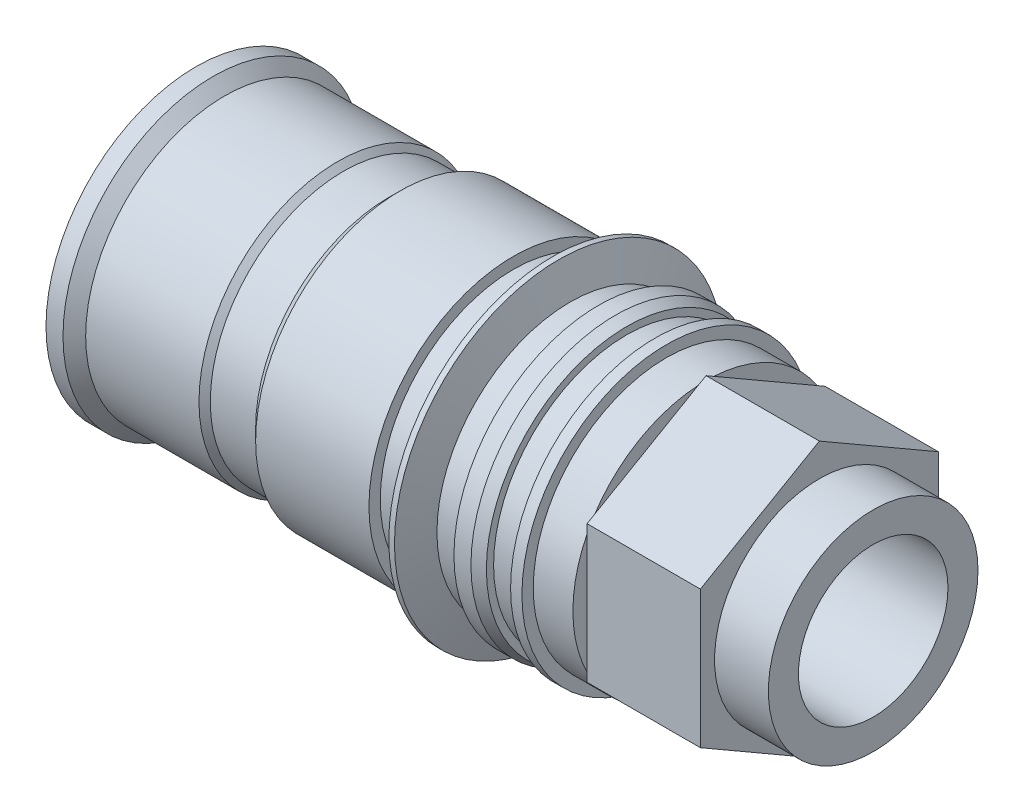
ISO-10303-21;
HEADER;
FILE_DESCRIPTION(('STEP AP214'),'2;1');
FILE_NAME('part.step','',(''),(''),'','','');
FILE_SCHEMA(('AUTOMOTIVE_DESIGN { 1 0 10303 214 1 1 1 1 }'));
ENDSEC;
DATA;
#1=APPLICATION_CONTEXT('core data for automotive mechanical design processes');
#2=APPLICATION_PROTOCOL_DEFINITION('international standard','automotive_design',2000,#1);
#3=PRODUCT_CONTEXT('',#1,'mechanical');
#4=PRODUCT('Part','Part','',(#3));
#5=PRODUCT_RELATED_PRODUCT_CATEGORY('part','',(#4));
#6=PRODUCT_DEFINITION_FORMATION('','',#4);
#7=PRODUCT_DEFINITION_CONTEXT('part definition',#1,'design');
#8=PRODUCT_DEFINITION('design','',#6,#7);
#9=PRODUCT_DEFINITION_SHAPE('','',#8);
#10=(LENGTH_UNIT() NAMED_UNIT(*) SI_UNIT(.MILLI.,.METRE.));
#11=(NAMED_UNIT(*) PLANE_ANGLE_UNIT() SI_UNIT($,.RADIAN.));
#12=(NAMED_UNIT(*) SI_UNIT($,.STERADIAN.) SOLID_ANGLE_UNIT());
#13=UNCERTAINTY_MEASURE_WITH_UNIT(LENGTH_MEASURE(1.E-05),#10,'distance_accuracy_value','');
#14=(GEOMETRIC_REPRESENTATION_CONTEXT(3) GLOBAL_UNCERTAINTY_ASSIGNED_CONTEXT((#13)) GLOBAL_UNIT_ASSIGNED_CONTEXT((#10,
#11,#12)) REPRESENTATION_CONTEXT('',''));
#15=CARTESIAN_POINT('',(0.,0.,0.));
#16=DIRECTION('',(0.,0.,1.));
#17=DIRECTION('',(1.,0.,0.));
#18=AXIS2_PLACEMENT_3D('',#15,#16,#17);
#19=CARTESIAN_POINT('',(90.,23.5,0.));
#20=DIRECTION('',(-1.,0.,0.));
#21=DIRECTION('',(0.,0.,1.));
#22=AXIS2_PLACEMENT_3D('',#19,#20,#21);
#23=PLANE('',#22);
#24=DIRECTION('',(0.,0.5,0.866025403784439));
#25=VECTOR('',#24,1.);
#26=CARTESIAN_POINT('',(90.,12.1243556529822,-21.));
#27=LINE('',#26,#25);
#28=CARTESIAN_POINT('',(90.,12.912777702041,-19.6344129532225));
#29=VERTEX_POINT('',#28);
#30=CARTESIAN_POINT('',(90.,23.4602892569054,-1.36558704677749));
#31=VERTEX_POINT('',#30);
#32=EDGE_CURVE('E42',#29,#31,#27,.T.);
#33=ORIENTED_EDGE('',*,*,#32,.F.);
#34=CARTESIAN_POINT('',(90.,0.,0.));
#35=DIRECTION('',(-1.,0.,0.));
#36=DIRECTION('',(0.,0.,1.));
#37=AXIS2_PLACEMENT_3D('',#34,#35,#36);
#38=CIRCLE('',#37,23.5);
#39=EDGE_CURVE('E297',#31,#29,#38,.T.);
#40=ORIENTED_EDGE('',*,*,#39,.F.);
#41=EDGE_LOOP('',(#33,#40));
#42=FACE_BOUND('',#41,.T.);
#43=ADVANCED_FACE('F33',(#42),#23,.F.);
#44=DIRECTION('',(0.,1.,0.));
#45=VECTOR('',#44,1.);
#46=CARTESIAN_POINT('',(90.,-12.1243556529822,-21.));
#47=LINE('',#46,#45);
#48=CARTESIAN_POINT('',(90.,-10.5475115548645,-21.));
#49=VERTEX_POINT('',#48);
#50=CARTESIAN_POINT('',(90.,10.5475115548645,-21.));
#51=VERTEX_POINT('',#50);
#52=EDGE_CURVE('E243',#49,#51,#47,.T.);
#53=ORIENTED_EDGE('',*,*,#52,.F.);
#54=EDGE_CURVE('E291',#51,#49,#38,.T.);
#55=ORIENTED_EDGE('',*,*,#54,.F.);
#56=EDGE_LOOP('',(#53,#55));
#57=FACE_BOUND('',#56,.T.);
#58=ADVANCED_FACE('F324',(#57),#23,.F.);
#59=DIRECTION('',(0.,0.5,-0.866025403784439));
#60=VECTOR('',#59,1.);
#61=CARTESIAN_POINT('',(90.,-24.2487113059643,0.));
#62=LINE('',#61,#60);
#63=CARTESIAN_POINT('',(90.,-23.4602892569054,-1.36558704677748));
#64=VERTEX_POINT('',#63);
#65=CARTESIAN_POINT('',(90.,-12.912777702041,-19.6344129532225));
#66=VERTEX_POINT('',#65);
#67=EDGE_CURVE('E245',#64,#66,#62,.T.);
#68=ORIENTED_EDGE('',*,*,#67,.F.);
#69=EDGE_CURVE('E285',#66,#64,#38,.T.);
#70=ORIENTED_EDGE('',*,*,#69,.F.);
#71=EDGE_LOOP('',(#68,#70));
#72=FACE_BOUND('',#71,.T.);
#73=ADVANCED_FACE('F331',(#72),#23,.F.);
#74=DIRECTION('',(0.,-0.5,-0.866025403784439));
#75=VECTOR('',#74,1.);
#76=CARTESIAN_POINT('',(90.,-12.1243556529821,21.));
#77=LINE('',#76,#75);
#78=CARTESIAN_POINT('',(90.,-12.912777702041,19.6344129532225));
#79=VERTEX_POINT('',#78);
#80=CARTESIAN_POINT('',(90.,-23.4602892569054,1.36558704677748));
#81=VERTEX_POINT('',#80);
#82=EDGE_CURVE('E56',#79,#81,#77,.T.);
#83=ORIENTED_EDGE('',*,*,#82,.F.);
#84=EDGE_CURVE('E282',#81,#79,#38,.T.);
#85=ORIENTED_EDGE('',*,*,#84,.F.);
#86=EDGE_LOOP('',(#83,#85));
#87=FACE_BOUND('',#86,.T.);
#88=ADVANCED_FACE('F343',(#87),#23,.F.);
#89=DIRECTION('',(0.,-1.,0.));
#90=VECTOR('',#89,1.);
#91=CARTESIAN_POINT('',(90.,12.1243556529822,21.));
#92=LINE('',#91,#90);
#93=CARTESIAN_POINT('',(90.,10.5475115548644,21.));
#94=VERTEX_POINT('',#93);
#95=CARTESIAN_POINT('',(90.,-10.5475115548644,21.));
#96=VERTEX_POINT('',#95);
#97=EDGE_CURVE('E229',#94,#96,#92,.T.);
#98=ORIENTED_EDGE('',*,*,#97,.F.);
#99=EDGE_CURVE('E49',#96,#94,#38,.T.);
#100=ORIENTED_EDGE('',*,*,#99,.F.);
#101=EDGE_LOOP('',(#98,#100));
#102=FACE_BOUND('',#101,.T.);
#103=ADVANCED_FACE('F336',(#102),#23,.F.);
#104=DIRECTION('',(0.,-0.5,0.866025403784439));
#105=VECTOR('',#104,1.);
#106=CARTESIAN_POINT('',(90.,24.2487113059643,0.));
#107=LINE('',#106,#105);
#108=CARTESIAN_POINT('',(90.,23.4602892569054,1.36558704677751));
#109=VERTEX_POINT('',#108);
#110=CARTESIAN_POINT('',(90.,12.912777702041,19.6344129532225));
#111=VERTEX_POINT('',#110);
#112=EDGE_CURVE('E225',#109,#111,#107,.T.);
#113=ORIENTED_EDGE('',*,*,#112,.F.);
#114=EDGE_CURVE('E161',#111,#109,#38,.T.);
#115=ORIENTED_EDGE('',*,*,#114,.F.);
#116=EDGE_LOOP('',(#113,#115));
#117=FACE_BOUND('',#116,.T.);
#118=ADVANCED_FACE('F327',(#117),#23,.F.);
#119=CARTESIAN_POINT('',(0.,0.,0.));
#120=DIRECTION('',(1.,0.,0.));
#121=DIRECTION('',(0.,0.,-1.));
#122=AXIS2_PLACEMENT_3D('',#119,#120,#121);
#123=PLANE('',#122);
#124=CARTESIAN_POINT('',(0.,0.,0.));
#125=DIRECTION('',(1.,0.,0.));
#126=DIRECTION('',(0.,0.,-1.));
#127=AXIS2_PLACEMENT_3D('',#124,#125,#126);
#128=CIRCLE('',#127,13.2);
#129=CARTESIAN_POINT('',(0.,0.,-13.2));
#130=VERTEX_POINT('',#129);
#131=EDGE_CURVE('E398',#130,#130,#128,.T.);
#132=ORIENTED_EDGE('',*,*,#131,.T.);
#133=EDGE_LOOP('',(#132));
#134=FACE_BOUND('',#133,.T.);
#135=CARTESIAN_POINT('',(0.,0.,0.));
#136=DIRECTION('',(-1.,0.,0.));
#137=DIRECTION('',(0.,0.,1.));
#138=AXIS2_PLACEMENT_3D('',#135,#136,#137);
#139=CIRCLE('',#138,26.5);
#140=CARTESIAN_POINT('',(0.,0.,26.5));
#141=VERTEX_POINT('',#140);
#142=EDGE_CURVE('E37',#141,#141,#139,.T.);
#143=ORIENTED_EDGE('',*,*,#142,.T.);
#144=EDGE_LOOP('',(#143));
#145=FACE_BOUND('',#144,.T.);
#146=ADVANCED_FACE('F35',(#134,#145),#123,.F.);
#147=CARTESIAN_POINT('',(0.,0.,0.));
#148=DIRECTION('',(-1.,0.,0.));
#149=DIRECTION('',(0.,0.,1.));
#150=AXIS2_PLACEMENT_3D('',#147,#148,#149);
#151=CYLINDRICAL_SURFACE('',#150,26.5);
#152=ORIENTED_EDGE('',*,*,#142,.F.);
#153=EDGE_LOOP('',(#152));
#154=FACE_BOUND('',#153,.T.);
#155=CARTESIAN_POINT('',(3.,0.,0.));
#156=DIRECTION('',(-1.,0.,0.));
#157=DIRECTION('',(0.,0.,1.));
#158=AXIS2_PLACEMENT_3D('',#155,#156,#157);
#159=CIRCLE('',#158,26.5);
#160=CARTESIAN_POINT('',(3.,0.,26.5));
#161=VERTEX_POINT('',#160);
#162=EDGE_CURVE('E220',#161,#161,#159,.T.);
#163=ORIENTED_EDGE('',*,*,#162,.T.);
#164=EDGE_LOOP('',(#163));
#165=FACE_BOUND('',#164,.T.);
#166=ADVANCED_FACE('F341',(#154,#165),#151,.T.);
#167=CARTESIAN_POINT('',(5.,0.,0.));
#168=DIRECTION('',(-1.,0.,0.));
#169=DIRECTION('',(0.,0.,1.));
#170=AXIS2_PLACEMENT_3D('',#167,#168,#169);
#171=CONICAL_SURFACE('',#170,24.5,0.78539816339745);
#172=ORIENTED_EDGE('',*,*,#162,.F.);
#173=EDGE_LOOP('',(#172));
#174=FACE_BOUND('',#173,.T.);
#175=CARTESIAN_POINT('',(5.,0.,0.));
#176=DIRECTION('',(-1.,0.,0.));
#177=DIRECTION('',(0.,0.,1.));
#178=AXIS2_PLACEMENT_3D('',#175,#176,#177);
#179=CIRCLE('',#178,24.5);
#180=CARTESIAN_POINT('',(5.,0.,24.5));
#181=VERTEX_POINT('',#180);
#182=EDGE_CURVE('E218',#181,#181,#179,.T.);
#183=ORIENTED_EDGE('',*,*,#182,.T.);
#184=EDGE_LOOP('',(#183));
#185=FACE_BOUND('',#184,.T.);
#186=ADVANCED_FACE('F440',(#174,#185),#171,.T.);
#187=CARTESIAN_POINT('',(0.,0.,0.));
#188=DIRECTION('',(-1.,0.,0.));
#189=DIRECTION('',(0.,0.,1.));
#190=AXIS2_PLACEMENT_3D('',#187,#188,#189);
#191=CYLINDRICAL_SURFACE('',#190,24.5);
#192=ORIENTED_EDGE('',*,*,#182,.F.);
#193=EDGE_LOOP('',(#192));
#194=FACE_BOUND('',#193,.T.);
#195=CARTESIAN_POINT('',(25.,0.,0.));
#196=DIRECTION('',(-1.,0.,0.));
#197=DIRECTION('',(0.,0.,1.));
#198=AXIS2_PLACEMENT_3D('',#195,#196,#197);
#199=CIRCLE('',#198,24.5);
#200=CARTESIAN_POINT('',(25.,0.,24.5));
#201=VERTEX_POINT('',#200);
#202=EDGE_CURVE('E215',#201,#201,#199,.T.);
#203=ORIENTED_EDGE('',*,*,#202,.T.);
#204=EDGE_LOOP('',(#203));
#205=FACE_BOUND('',#204,.T.);
#206=ADVANCED_FACE('F446',(#194,#205),#191,.T.);
#207=CARTESIAN_POINT('',(26.,0.,0.));
#208=DIRECTION('',(-1.,0.,0.));
#209=DIRECTION('',(0.,0.,1.));
#210=AXIS2_PLACEMENT_3D('',#207,#208,#209);
#211=CONICAL_SURFACE('',#210,23.5,0.785398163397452);
#212=ORIENTED_EDGE('',*,*,#202,.F.);
#213=EDGE_LOOP('',(#212));
#214=FACE_BOUND('',#213,.T.);
#215=CARTESIAN_POINT('',(26.,0.,0.));
#216=DIRECTION('',(-1.,0.,0.));
#217=DIRECTION('',(0.,0.,1.));
#218=AXIS2_PLACEMENT_3D('',#215,#216,#217);
#219=CIRCLE('',#218,23.5);
#220=CARTESIAN_POINT('',(26.,0.,23.5));
#221=VERTEX_POINT('',#220);
#222=EDGE_CURVE('E212',#221,#221,#219,.T.);
#223=ORIENTED_EDGE('',*,*,#222,.T.);
#224=EDGE_LOOP('',(#223));
#225=FACE_BOUND('',#224,.T.);
#226=ADVANCED_FACE('F454',(#214,#225),#211,.T.);
#227=CARTESIAN_POINT('',(0.,0.,0.));
#228=DIRECTION('',(-1.,0.,0.));
#229=DIRECTION('',(0.,0.,1.));
#230=AXIS2_PLACEMENT_3D('',#227,#228,#229);
#231=CYLINDRICAL_SURFACE('',#230,23.5);
#232=ORIENTED_EDGE('',*,*,#222,.F.);
#233=EDGE_LOOP('',(#232));
#234=FACE_BOUND('',#233,.T.);
#235=CARTESIAN_POINT('',(34.,0.,0.));
#236=DIRECTION('',(-1.,0.,0.));
#237=DIRECTION('',(0.,0.,1.));
#238=AXIS2_PLACEMENT_3D('',#235,#236,#237);
#239=CIRCLE('',#238,23.5);
#240=CARTESIAN_POINT('',(34.,0.,23.5));
#241=VERTEX_POINT('',#240);
#242=EDGE_CURVE('E209',#241,#241,#239,.T.);
#243=ORIENTED_EDGE('',*,*,#242,.T.);
#244=EDGE_LOOP('',(#243));
#245=FACE_BOUND('',#244,.T.);
#246=ADVANCED_FACE('F462',(#234,#245),#231,.T.);
#247=CARTESIAN_POINT('',(36.,0.,0.));
#248=DIRECTION('',(1.,0.,0.));
#249=DIRECTION('',(0.,0.,-1.));
#250=AXIS2_PLACEMENT_3D('',#247,#248,#249);
#251=CONICAL_SURFACE('',#250,25.5,0.785398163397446);
#252=ORIENTED_EDGE('',*,*,#242,.F.);
#253=EDGE_LOOP('',(#252));
#254=FACE_BOUND('',#253,.T.);
#255=CARTESIAN_POINT('',(36.,0.,0.));
#256=DIRECTION('',(-1.,0.,0.));
#257=DIRECTION('',(0.,0.,1.));
#258=AXIS2_PLACEMENT_3D('',#255,#256,#257);
#259=CIRCLE('',#258,25.5);
#260=CARTESIAN_POINT('',(36.,0.,25.5));
#261=VERTEX_POINT('',#260);
#262=EDGE_CURVE('E206',#261,#261,#259,.T.);
#263=ORIENTED_EDGE('',*,*,#262,.T.);
#264=EDGE_LOOP('',(#263));
#265=FACE_BOUND('',#264,.T.);
#266=ADVANCED_FACE('F470',(#254,#265),#251,.T.);
#267=CARTESIAN_POINT('',(0.,0.,0.));
#268=DIRECTION('',(-1.,0.,0.));
#269=DIRECTION('',(0.,0.,1.));
#270=AXIS2_PLACEMENT_3D('',#267,#268,#269);
#271=CYLINDRICAL_SURFACE('',#270,25.5);
#272=ORIENTED_EDGE('',*,*,#262,.F.);
#273=EDGE_LOOP('',(#272));
#274=FACE_BOUND('',#273,.T.);
#275=CARTESIAN_POINT('',(56.,0.,0.));
#276=DIRECTION('',(-1.,0.,0.));
#277=DIRECTION('',(0.,0.,1.));
#278=AXIS2_PLACEMENT_3D('',#275,#276,#277);
#279=CIRCLE('',#278,25.5);
#280=CARTESIAN_POINT('',(56.,0.,25.5));
#281=VERTEX_POINT('',#280);
#282=EDGE_CURVE('E203',#281,#281,#279,.T.);
#283=ORIENTED_EDGE('',*,*,#282,.T.);
#284=EDGE_LOOP('',(#283));
#285=FACE_BOUND('',#284,.T.);
#286=ADVANCED_FACE('F478',(#274,#285),#271,.T.);
#287=CARTESIAN_POINT('',(56.,25.5,0.));
#288=DIRECTION('',(-1.,0.,0.));
#289=DIRECTION('',(0.,0.,1.));
#290=AXIS2_PLACEMENT_3D('',#287,#288,#289);
#291=PLANE('',#290);
#292=ORIENTED_EDGE('',*,*,#282,.F.);
#293=EDGE_LOOP('',(#292));
#294=FACE_BOUND('',#293,.T.);
#295=CARTESIAN_POINT('',(56.,0.,0.));
#296=DIRECTION('',(-1.,0.,0.));
#297=DIRECTION('',(0.,0.,1.));
#298=AXIS2_PLACEMENT_3D('',#295,#296,#297);
#299=CIRCLE('',#298,23.5);
#300=CARTESIAN_POINT('',(56.,0.,23.5));
#301=VERTEX_POINT('',#300);
#302=EDGE_CURVE('E200',#301,#301,#299,.T.);
#303=ORIENTED_EDGE('',*,*,#302,.T.);
#304=EDGE_LOOP('',(#303));
#305=FACE_BOUND('',#304,.T.);
#306=ADVANCED_FACE('F486',(#294,#305),#291,.F.);
#307=CARTESIAN_POINT('',(0.,0.,0.));
#308=DIRECTION('',(-1.,0.,0.));
#309=DIRECTION('',(0.,0.,1.));
#310=AXIS2_PLACEMENT_3D('',#307,#308,#309);
#311=CYLINDRICAL_SURFACE('',#310,23.5);
#312=ORIENTED_EDGE('',*,*,#302,.F.);
#313=EDGE_LOOP('',(#312));
#314=FACE_BOUND('',#313,.T.);
#315=CARTESIAN_POINT('',(61.,0.,0.));
#316=DIRECTION('',(-1.,0.,0.));
#317=DIRECTION('',(0.,0.,1.));
#318=AXIS2_PLACEMENT_3D('',#315,#316,#317);
#319=CIRCLE('',#318,23.5);
#320=CARTESIAN_POINT('',(61.,0.,23.5));
#321=VERTEX_POINT('',#320);
#322=EDGE_CURVE('E197',#321,#321,#319,.T.);
#323=ORIENTED_EDGE('',*,*,#322,.T.);
#324=EDGE_LOOP('',(#323));
#325=FACE_BOUND('',#324,.T.);
#326=ADVANCED_FACE('F494',(#314,#325),#311,.T.);
#327=CARTESIAN_POINT('',(63.,0.,0.));
#328=DIRECTION('',(1.,0.,0.));
#329=DIRECTION('',(0.,0.,-1.));
#330=AXIS2_PLACEMENT_3D('',#327,#328,#329);
#331=CONICAL_SURFACE('',#330,28.9949548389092,1.22173047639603);
#332=ORIENTED_EDGE('',*,*,#322,.F.);
#333=EDGE_LOOP('',(#332));
#334=FACE_BOUND('',#333,.T.);
#335=CARTESIAN_POINT('',(63.,0.,0.));
#336=DIRECTION('',(-1.,0.,0.));
#337=DIRECTION('',(0.,0.,1.));
#338=AXIS2_PLACEMENT_3D('',#335,#336,#337);
#339=CIRCLE('',#338,28.9949548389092);
#340=CARTESIAN_POINT('',(63.,0.,28.9949548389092));
#341=VERTEX_POINT('',#340);
#342=EDGE_CURVE('E194',#341,#341,#339,.T.);
#343=ORIENTED_EDGE('',*,*,#342,.T.);
#344=EDGE_LOOP('',(#343));
#345=FACE_BOUND('',#344,.T.);
#346=ADVANCED_FACE('F502',(#334,#345),#331,.T.);
#347=CARTESIAN_POINT('',(0.,0.,0.));
#348=DIRECTION('',(-1.,0.,0.));
#349=DIRECTION('',(0.,0.,1.));
#350=AXIS2_PLACEMENT_3D('',#347,#348,#349);
#351=CYLINDRICAL_SURFACE('',#350,28.9949548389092);
#352=ORIENTED_EDGE('',*,*,#342,.F.);
#353=EDGE_LOOP('',(#352));
#354=FACE_BOUND('',#353,.T.);
#355=CARTESIAN_POINT('',(64.,0.,0.));
#356=DIRECTION('',(-1.,0.,0.));
#357=DIRECTION('',(0.,0.,1.));
#358=AXIS2_PLACEMENT_3D('',#355,#356,#357);
#359=CIRCLE('',#358,28.9949548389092);
#360=CARTESIAN_POINT('',(64.,0.,28.9949548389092));
#361=VERTEX_POINT('',#360);
#362=EDGE_CURVE('E191',#361,#361,#359,.T.);
#363=ORIENTED_EDGE('',*,*,#362,.T.);
#364=EDGE_LOOP('',(#363));
#365=FACE_BOUND('',#364,.T.);
#366=ADVANCED_FACE('F510',(#354,#365),#351,.T.);
#367=CARTESIAN_POINT('',(66.,0.,0.));
#368=DIRECTION('',(-1.,0.,0.));
#369=DIRECTION('',(0.,0.,1.));
#370=AXIS2_PLACEMENT_3D('',#367,#368,#369);
#371=CONICAL_SURFACE('',#370,23.5,1.22173047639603);
#372=ORIENTED_EDGE('',*,*,#362,.F.);
#373=EDGE_LOOP('',(#372));
#374=FACE_BOUND('',#373,.T.);
#375=CARTESIAN_POINT('',(66.,0.,0.));
#376=DIRECTION('',(-1.,0.,0.));
#377=DIRECTION('',(0.,0.,1.));
#378=AXIS2_PLACEMENT_3D('',#375,#376,#377);
#379=CIRCLE('',#378,23.5);
#380=CARTESIAN_POINT('',(66.,0.,23.5));
#381=VERTEX_POINT('',#380);
#382=EDGE_CURVE('E188',#381,#381,#379,.T.);
#383=ORIENTED_EDGE('',*,*,#382,.T.);
#384=EDGE_LOOP('',(#383));
#385=FACE_BOUND('',#384,.T.);
#386=ADVANCED_FACE('F518',(#374,#385),#371,.T.);
#387=CARTESIAN_POINT('',(0.,0.,0.));
#388=DIRECTION('',(-1.,0.,0.));
#389=DIRECTION('',(0.,0.,1.));
#390=AXIS2_PLACEMENT_3D('',#387,#388,#389);
#391=CYLINDRICAL_SURFACE('',#390,23.5);
#392=ORIENTED_EDGE('',*,*,#382,.F.);
#393=EDGE_LOOP('',(#392));
#394=FACE_BOUND('',#393,.T.);
#395=CARTESIAN_POINT('',(71.,0.,0.));
#396=DIRECTION('',(-1.,0.,0.));
#397=DIRECTION('',(0.,0.,1.));
#398=AXIS2_PLACEMENT_3D('',#395,#396,#397);
#399=CIRCLE('',#398,23.5);
#400=CARTESIAN_POINT('',(71.,0.,23.5));
#401=VERTEX_POINT('',#400);
#402=EDGE_CURVE('E185',#401,#401,#399,.T.);
#403=ORIENTED_EDGE('',*,*,#402,.T.);
#404=EDGE_LOOP('',(#403));
#405=FACE_BOUND('',#404,.T.);
#406=ADVANCED_FACE('F526',(#394,#405),#391,.T.);
#407=CARTESIAN_POINT('',(71.,23.5,0.));
#408=DIRECTION('',(1.,0.,0.));
#409=DIRECTION('',(0.,0.,-1.));
#410=AXIS2_PLACEMENT_3D('',#407,#408,#409);
#411=PLANE('',#410);
#412=ORIENTED_EDGE('',*,*,#402,.F.);
#413=EDGE_LOOP('',(#412));
#414=FACE_BOUND('',#413,.T.);
#415=CARTESIAN_POINT('',(71.,0.,0.));
#416=DIRECTION('',(-1.,0.,0.));
#417=DIRECTION('',(0.,0.,1.));
#418=AXIS2_PLACEMENT_3D('',#415,#416,#417);
#419=CIRCLE('',#418,25.5);
#420=CARTESIAN_POINT('',(71.,0.,25.5));
#421=VERTEX_POINT('',#420);
#422=EDGE_CURVE('E182',#421,#421,#419,.T.);
#423=ORIENTED_EDGE('',*,*,#422,.T.);
#424=EDGE_LOOP('',(#423));
#425=FACE_BOUND('',#424,.T.);
#426=ADVANCED_FACE('F534',(#414,#425),#411,.F.);
#427=CARTESIAN_POINT('',(0.,0.,0.));
#428=DIRECTION('',(-1.,0.,0.));
#429=DIRECTION('',(0.,0.,1.));
#430=AXIS2_PLACEMENT_3D('',#427,#428,#429);
#431=CYLINDRICAL_SURFACE('',#430,25.5);
#432=ORIENTED_EDGE('',*,*,#422,.F.);
#433=EDGE_LOOP('',(#432));
#434=FACE_BOUND('',#433,.T.);
#435=CARTESIAN_POINT('',(74.,0.,0.));
#436=DIRECTION('',(-1.,0.,0.));
#437=DIRECTION('',(0.,0.,1.));
#438=AXIS2_PLACEMENT_3D('',#435,#436,#437);
#439=CIRCLE('',#438,25.5);
#440=CARTESIAN_POINT('',(74.,0.,25.5));
#441=VERTEX_POINT('',#440);
#442=EDGE_CURVE('E179',#441,#441,#439,.T.);
#443=ORIENTED_EDGE('',*,*,#442,.T.);
#444=EDGE_LOOP('',(#443));
#445=FACE_BOUND('',#444,.T.);
#446=ADVANCED_FACE('F542',(#434,#445),#431,.T.);
#447=CARTESIAN_POINT('',(76.,0.,0.));
#448=DIRECTION('',(-1.,0.,0.));
#449=DIRECTION('',(0.,0.,1.));
#450=AXIS2_PLACEMENT_3D('',#447,#448,#449);
#451=CONICAL_SURFACE('',#450,24.7720595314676,0.349065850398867);
#452=ORIENTED_EDGE('',*,*,#442,.F.);
#453=EDGE_LOOP('',(#452));
#454=FACE_BOUND('',#453,.T.);
#455=CARTESIAN_POINT('',(76.,0.,0.));
#456=DIRECTION('',(-1.,0.,0.));
#457=DIRECTION('',(0.,0.,1.));
#458=AXIS2_PLACEMENT_3D('',#455,#456,#457);
#459=CIRCLE('',#458,24.7720595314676);
#460=CARTESIAN_POINT('',(76.,0.,24.7720595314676));
#461=VERTEX_POINT('',#460);
#462=EDGE_CURVE('E176',#461,#461,#459,.T.);
#463=ORIENTED_EDGE('',*,*,#462,.T.);
#464=EDGE_LOOP('',(#463));
#465=FACE_BOUND('',#464,.T.);
#466=ADVANCED_FACE('F550',(#454,#465),#451,.T.);
#467=CARTESIAN_POINT('',(76.,24.7720595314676,0.));
#468=DIRECTION('',(-1.,0.,0.));
#469=DIRECTION('',(0.,0.,1.));
#470=AXIS2_PLACEMENT_3D('',#467,#468,#469);
#471=PLANE('',#470);
#472=ORIENTED_EDGE('',*,*,#462,.F.);
#473=EDGE_LOOP('',(#472));
#474=FACE_BOUND('',#473,.T.);
#475=CARTESIAN_POINT('',(76.,0.,0.));
#476=DIRECTION('',(-1.,0.,0.));
#477=DIRECTION('',(0.,0.,1.));
#478=AXIS2_PLACEMENT_3D('',#475,#476,#477);
#479=CIRCLE('',#478,23.5);
#480=CARTESIAN_POINT('',(76.,0.,23.5));
#481=VERTEX_POINT('',#480);
#482=EDGE_CURVE('E173',#481,#481,#479,.T.);
#483=ORIENTED_EDGE('',*,*,#482,.T.);
#484=EDGE_LOOP('',(#483));
#485=FACE_BOUND('',#484,.T.);
#486=ADVANCED_FACE('F558',(#474,#485),#471,.F.);
#487=CARTESIAN_POINT('',(0.,0.,0.));
#488=DIRECTION('',(-1.,0.,0.));
#489=DIRECTION('',(0.,0.,1.));
#490=AXIS2_PLACEMENT_3D('',#487,#488,#489);
#491=CYLINDRICAL_SURFACE('',#490,23.5);
#492=ORIENTED_EDGE('',*,*,#482,.F.);
#493=EDGE_LOOP('',(#492));
#494=FACE_BOUND('',#493,.T.);
#495=CARTESIAN_POINT('',(81.,0.,0.));
#496=DIRECTION('',(-1.,0.,0.));
#497=DIRECTION('',(0.,0.,1.));
#498=AXIS2_PLACEMENT_3D('',#495,#496,#497);
#499=CIRCLE('',#498,23.5);
#500=CARTESIAN_POINT('',(81.,0.,23.5));
#501=VERTEX_POINT('',#500);
#502=EDGE_CURVE('E170',#501,#501,#499,.T.);
#503=ORIENTED_EDGE('',*,*,#502,.T.);
#504=EDGE_LOOP('',(#503));
#505=FACE_BOUND('',#504,.T.);
#506=ADVANCED_FACE('F566',(#494,#505),#491,.T.);
#507=CARTESIAN_POINT('',(81.,23.5,0.));
#508=DIRECTION('',(1.,0.,0.));
#509=DIRECTION('',(0.,0.,-1.));
#510=AXIS2_PLACEMENT_3D('',#507,#508,#509);
#511=PLANE('',#510);
#512=ORIENTED_EDGE('',*,*,#502,.F.);
#513=EDGE_LOOP('',(#512));
#514=FACE_BOUND('',#513,.T.);
#515=CARTESIAN_POINT('',(81.,0.,0.));
#516=DIRECTION('',(-1.,0.,0.));
#517=DIRECTION('',(0.,0.,1.));
#518=AXIS2_PLACEMENT_3D('',#515,#516,#517);
#519=CIRCLE('',#518,25.5);
#520=CARTESIAN_POINT('',(81.,0.,25.5));
#521=VERTEX_POINT('',#520);
#522=EDGE_CURVE('E167',#521,#521,#519,.T.);
#523=ORIENTED_EDGE('',*,*,#522,.T.);
#524=EDGE_LOOP('',(#523));
#525=FACE_BOUND('',#524,.T.);
#526=ADVANCED_FACE('F574',(#514,#525),#511,.F.);
#527=CARTESIAN_POINT('',(0.,0.,0.));
#528=DIRECTION('',(-1.,0.,0.));
#529=DIRECTION('',(0.,0.,1.));
#530=AXIS2_PLACEMENT_3D('',#527,#528,#529);
#531=CYLINDRICAL_SURFACE('',#530,25.5);
#532=ORIENTED_EDGE('',*,*,#522,.F.);
#533=EDGE_LOOP('',(#532));
#534=FACE_BOUND('',#533,.T.);
#535=CARTESIAN_POINT('',(83.,0.,0.));
#536=DIRECTION('',(-1.,0.,0.));
#537=DIRECTION('',(0.,0.,1.));
#538=AXIS2_PLACEMENT_3D('',#535,#536,#537);
#539=CIRCLE('',#538,25.5);
#540=CARTESIAN_POINT('',(83.,0.,25.5));
#541=VERTEX_POINT('',#540);
#542=EDGE_CURVE('E164',#541,#541,#539,.T.);
#543=ORIENTED_EDGE('',*,*,#542,.T.);
#544=EDGE_LOOP('',(#543));
#545=FACE_BOUND('',#544,.T.);
#546=ADVANCED_FACE('F582',(#534,#545),#531,.T.);
#547=CARTESIAN_POINT('',(83.,25.5,0.));
#548=DIRECTION('',(-1.,0.,0.));
#549=DIRECTION('',(0.,0.,1.));
#550=AXIS2_PLACEMENT_3D('',#547,#548,#549);
#551=PLANE('',#550);
#552=ORIENTED_EDGE('',*,*,#542,.F.);
#553=EDGE_LOOP('',(#552));
#554=FACE_BOUND('',#553,.T.);
#555=CARTESIAN_POINT('',(83.,0.,0.));
#556=DIRECTION('',(-1.,0.,0.));
#557=DIRECTION('',(0.,0.,1.));
#558=AXIS2_PLACEMENT_3D('',#555,#556,#557);
#559=CIRCLE('',#558,23.5);
#560=CARTESIAN_POINT('',(83.,0.,23.5));
#561=VERTEX_POINT('',#560);
#562=EDGE_CURVE('E160',#561,#561,#559,.T.);
#563=ORIENTED_EDGE('',*,*,#562,.T.);
#564=EDGE_LOOP('',(#563));
#565=FACE_BOUND('',#564,.T.);
#566=ADVANCED_FACE('F590',(#554,#565),#551,.F.);
#567=CARTESIAN_POINT('',(0.,0.,0.));
#568=DIRECTION('',(-1.,0.,0.));
#569=DIRECTION('',(0.,0.,1.));
#570=AXIS2_PLACEMENT_3D('',#567,#568,#569);
#571=CYLINDRICAL_SURFACE('',#570,23.5);
#572=ORIENTED_EDGE('',*,*,#562,.F.);
#573=EDGE_LOOP('',(#572));
#574=FACE_BOUND('',#573,.T.);
#575=EDGE_CURVE('E155',#94,#111,#38,.T.);
#576=ORIENTED_EDGE('',*,*,#575,.T.);
#577=ORIENTED_EDGE('',*,*,#114,.T.);
#578=EDGE_CURVE('E300',#109,#31,#38,.T.);
#579=ORIENTED_EDGE('',*,*,#578,.T.);
#580=ORIENTED_EDGE('',*,*,#39,.T.);
#581=EDGE_CURVE('E295',#29,#51,#38,.T.);
#582=ORIENTED_EDGE('',*,*,#581,.T.);
#583=ORIENTED_EDGE('',*,*,#54,.T.);
#584=EDGE_CURVE('E289',#49,#66,#38,.T.);
#585=ORIENTED_EDGE('',*,*,#584,.T.);
#586=ORIENTED_EDGE('',*,*,#69,.T.);
#587=EDGE_CURVE('E283',#64,#81,#38,.T.);
#588=ORIENTED_EDGE('',*,*,#587,.T.);
#589=ORIENTED_EDGE('',*,*,#84,.T.);
#590=EDGE_CURVE('E153',#79,#96,#38,.T.);
#591=ORIENTED_EDGE('',*,*,#590,.T.);
#592=ORIENTED_EDGE('',*,*,#99,.T.);
#593=EDGE_LOOP('',(#576,#577,#579,#580,#582,#583,#585,#586,#588,#589,#591,#592));
#594=FACE_BOUND('',#593,.T.);
#595=ADVANCED_FACE('F305',(#574,#594),#571,.T.);
#596=CARTESIAN_POINT('',(90.,0.,0.));
#597=DIRECTION('',(1.,0.,0.));
#598=DIRECTION('',(0.,0.,-1.));
#599=AXIS2_PLACEMENT_3D('',#596,#597,#598);
#600=PLANE('',#599);
#601=ORIENTED_EDGE('',*,*,#575,.F.);
#602=CARTESIAN_POINT('',(90.,12.1243556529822,21.));
#603=VERTEX_POINT('',#602);
#604=EDGE_CURVE('E235',#603,#94,#92,.T.);
#605=ORIENTED_EDGE('',*,*,#604,.F.);
#606=EDGE_CURVE('E232',#111,#603,#107,.T.);
#607=ORIENTED_EDGE('',*,*,#606,.F.);
#608=EDGE_LOOP('',(#601,#605,#607));
#609=FACE_BOUND('',#608,.T.);
#610=ADVANCED_FACE('F312',(#609),#600,.F.);
#611=ORIENTED_EDGE('',*,*,#578,.F.);
#612=CARTESIAN_POINT('',(90.,24.2487113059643,0.));
#613=VERTEX_POINT('',#612);
#614=EDGE_CURVE('E231',#613,#109,#107,.T.);
#615=ORIENTED_EDGE('',*,*,#614,.F.);
#616=EDGE_CURVE('E150',#31,#613,#27,.T.);
#617=ORIENTED_EDGE('',*,*,#616,.F.);
#618=EDGE_LOOP('',(#611,#615,#617));
#619=FACE_BOUND('',#618,.T.);
#620=ADVANCED_FACE('F309',(#619),#600,.F.);
#621=ORIENTED_EDGE('',*,*,#581,.F.);
#622=CARTESIAN_POINT('',(90.,12.1243556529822,-21.));
#623=VERTEX_POINT('',#622);
#624=EDGE_CURVE('E238',#623,#29,#27,.T.);
#625=ORIENTED_EDGE('',*,*,#624,.F.);
#626=EDGE_CURVE('E247',#51,#623,#47,.T.);
#627=ORIENTED_EDGE('',*,*,#626,.F.);
#628=EDGE_LOOP('',(#621,#625,#627));
#629=FACE_BOUND('',#628,.T.);
#630=ADVANCED_FACE('F311',(#629),#600,.F.);
#631=ORIENTED_EDGE('',*,*,#584,.F.);
#632=CARTESIAN_POINT('',(90.,-12.1243556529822,-21.));
#633=VERTEX_POINT('',#632);
#634=EDGE_CURVE('E144',#633,#49,#47,.T.);
#635=ORIENTED_EDGE('',*,*,#634,.F.);
#636=EDGE_CURVE('E253',#66,#633,#62,.T.);
#637=ORIENTED_EDGE('',*,*,#636,.F.);
#638=EDGE_LOOP('',(#631,#635,#637));
#639=FACE_BOUND('',#638,.T.);
#640=ADVANCED_FACE('F318',(#639),#600,.F.);
#641=ORIENTED_EDGE('',*,*,#587,.F.);
#642=CARTESIAN_POINT('',(90.,-24.2487113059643,0.));
#643=VERTEX_POINT('',#642);
#644=EDGE_CURVE('E252',#643,#64,#62,.T.);
#645=ORIENTED_EDGE('',*,*,#644,.F.);
#646=EDGE_CURVE('E263',#81,#643,#77,.T.);
#647=ORIENTED_EDGE('',*,*,#646,.F.);
#648=EDGE_LOOP('',(#641,#645,#647));
#649=FACE_BOUND('',#648,.T.);
#650=ADVANCED_FACE('F364',(#649),#600,.F.);
#651=CARTESIAN_POINT('',(110.,12.1243556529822,-21.));
#652=DIRECTION('',(0.,-0.866025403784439,0.5));
#653=DIRECTION('',(0.,-0.5,-0.866025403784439));
#654=AXIS2_PLACEMENT_3D('',#651,#652,#653);
#655=PLANE('',#654);
#656=ORIENTED_EDGE('',*,*,#624,.T.);
#657=ORIENTED_EDGE('',*,*,#32,.T.);
#658=ORIENTED_EDGE('',*,*,#616,.T.);
#659=DIRECTION('',(-1.,0.,0.));
#660=VECTOR('',#659,1.);
#661=CARTESIAN_POINT('',(110.,24.2487113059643,0.));
#662=LINE('',#661,#660);
#663=CARTESIAN_POINT('',(110.,24.2487113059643,0.));
#664=VERTEX_POINT('',#663);
#665=EDGE_CURVE('E129',#664,#613,#662,.T.);
#666=ORIENTED_EDGE('',*,*,#665,.F.);
#667=DIRECTION('',(0.,0.5,0.866025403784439));
#668=VECTOR('',#667,1.);
#669=CARTESIAN_POINT('',(110.,12.1243556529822,-21.));
#670=LINE('',#669,#668);
#671=CARTESIAN_POINT('',(110.,12.1243556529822,-21.));
#672=VERTEX_POINT('',#671);
#673=EDGE_CURVE('E135',#672,#664,#670,.T.);
#674=ORIENTED_EDGE('',*,*,#673,.F.);
#675=DIRECTION('',(-1.,0.,0.));
#676=VECTOR('',#675,1.);
#677=CARTESIAN_POINT('',(110.,12.1243556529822,-21.));
#678=LINE('',#677,#676);
#679=EDGE_CURVE('E361',#672,#623,#678,.T.);
#680=ORIENTED_EDGE('',*,*,#679,.T.);
#681=EDGE_LOOP('',(#656,#657,#658,#666,#674,#680));
#682=FACE_BOUND('',#681,.T.);
#683=ADVANCED_FACE('F147',(#682),#655,.F.);
#684=CARTESIAN_POINT('',(110.,24.2487113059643,0.));
#685=DIRECTION('',(0.,-0.866025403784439,-0.5));
#686=DIRECTION('',(0.,0.5,-0.866025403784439));
#687=AXIS2_PLACEMENT_3D('',#684,#685,#686);
#688=PLANE('',#687);
#689=ORIENTED_EDGE('',*,*,#614,.T.);
#690=ORIENTED_EDGE('',*,*,#112,.T.);
#691=ORIENTED_EDGE('',*,*,#606,.T.);
#692=DIRECTION('',(-1.,0.,0.));
#693=VECTOR('',#692,1.);
#694=CARTESIAN_POINT('',(110.,12.1243556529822,21.));
#695=LINE('',#694,#693);
#696=CARTESIAN_POINT('',(110.,12.1243556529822,21.));
#697=VERTEX_POINT('',#696);
#698=EDGE_CURVE('E131',#697,#603,#695,.T.);
#699=ORIENTED_EDGE('',*,*,#698,.F.);
#700=DIRECTION('',(0.,-0.5,0.866025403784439));
#701=VECTOR('',#700,1.);
#702=CARTESIAN_POINT('',(110.,24.2487113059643,0.));
#703=LINE('',#702,#701);
#704=EDGE_CURVE('E124',#664,#697,#703,.T.);
#705=ORIENTED_EDGE('',*,*,#704,.F.);
#706=ORIENTED_EDGE('',*,*,#665,.T.);
#707=EDGE_LOOP('',(#689,#690,#691,#699,#705,#706));
#708=FACE_BOUND('',#707,.T.);
#709=ADVANCED_FACE('F127',(#708),#688,.F.);
#710=CARTESIAN_POINT('',(110.,12.1243556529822,21.));
#711=DIRECTION('',(0.,0.,-1.));
#712=DIRECTION('',(-1.,0.,0.));
#713=AXIS2_PLACEMENT_3D('',#710,#711,#712);
#714=PLANE('',#713);
#715=ORIENTED_EDGE('',*,*,#604,.T.);
#716=ORIENTED_EDGE('',*,*,#97,.T.);
#717=CARTESIAN_POINT('',(90.,-12.1243556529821,21.));
#718=VERTEX_POINT('',#717);
#719=EDGE_CURVE('E236',#96,#718,#92,.T.);
#720=ORIENTED_EDGE('',*,*,#719,.T.);
#721=DIRECTION('',(-1.,0.,0.));
#722=VECTOR('',#721,1.);
#723=CARTESIAN_POINT('',(110.,-12.1243556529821,21.));
#724=LINE('',#723,#722);
#725=CARTESIAN_POINT('',(110.,-12.1243556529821,21.));
#726=VERTEX_POINT('',#725);
#727=EDGE_CURVE('E156',#726,#718,#724,.T.);
#728=ORIENTED_EDGE('',*,*,#727,.F.);
#729=DIRECTION('',(0.,-1.,0.));
#730=VECTOR('',#729,1.);
#731=CARTESIAN_POINT('',(110.,12.1243556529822,21.));
#732=LINE('',#731,#730);
#733=EDGE_CURVE('E134',#697,#726,#732,.T.);
#734=ORIENTED_EDGE('',*,*,#733,.F.);
#735=ORIENTED_EDGE('',*,*,#698,.T.);
#736=EDGE_LOOP('',(#715,#716,#720,#728,#734,#735));
#737=FACE_BOUND('',#736,.T.);
#738=ADVANCED_FACE('F270',(#737),#714,.F.);
#739=CARTESIAN_POINT('',(110.,-12.1243556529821,21.));
#740=DIRECTION('',(0.,0.866025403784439,-0.5));
#741=DIRECTION('',(0.,0.5,0.866025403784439));
#742=AXIS2_PLACEMENT_3D('',#739,#740,#741);
#743=PLANE('',#742);
#744=EDGE_CURVE('E260',#718,#79,#77,.T.);
#745=ORIENTED_EDGE('',*,*,#744,.T.);
#746=ORIENTED_EDGE('',*,*,#82,.T.);
#747=ORIENTED_EDGE('',*,*,#646,.T.);
#748=DIRECTION('',(-1.,0.,0.));
#749=VECTOR('',#748,1.);
#750=CARTESIAN_POINT('',(110.,-24.2487113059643,0.));
#751=LINE('',#750,#749);
#752=CARTESIAN_POINT('',(110.,-24.2487113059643,0.));
#753=VERTEX_POINT('',#752);
#754=EDGE_CURVE('E279',#753,#643,#751,.T.);
#755=ORIENTED_EDGE('',*,*,#754,.F.);
#756=DIRECTION('',(0.,-0.5,-0.866025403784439));
#757=VECTOR('',#756,1.);
#758=CARTESIAN_POINT('',(110.,-12.1243556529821,21.));
#759=LINE('',#758,#757);
#760=EDGE_CURVE('E278',#726,#753,#759,.T.);
#761=ORIENTED_EDGE('',*,*,#760,.F.);
#762=ORIENTED_EDGE('',*,*,#727,.T.);
#763=EDGE_LOOP('',(#745,#746,#747,#755,#761,#762));
#764=FACE_BOUND('',#763,.T.);
#765=ADVANCED_FACE('F276',(#764),#743,.F.);
#766=CARTESIAN_POINT('',(110.,-24.2487113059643,0.));
#767=DIRECTION('',(0.,0.866025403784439,0.5));
#768=DIRECTION('',(0.,-0.5,0.866025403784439));
#769=AXIS2_PLACEMENT_3D('',#766,#767,#768);
#770=PLANE('',#769);
#771=ORIENTED_EDGE('',*,*,#644,.T.);
#772=ORIENTED_EDGE('',*,*,#67,.T.);
#773=ORIENTED_EDGE('',*,*,#636,.T.);
#774=DIRECTION('',(-1.,0.,0.));
#775=VECTOR('',#774,1.);
#776=CARTESIAN_POINT('',(110.,-12.1243556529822,-21.));
#777=LINE('',#776,#775);
#778=CARTESIAN_POINT('',(110.,-12.1243556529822,-21.));
#779=VERTEX_POINT('',#778);
#780=EDGE_CURVE('E357',#779,#633,#777,.T.);
#781=ORIENTED_EDGE('',*,*,#780,.F.);
#782=DIRECTION('',(0.,0.5,-0.866025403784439));
#783=VECTOR('',#782,1.);
#784=CARTESIAN_POINT('',(110.,-24.2487113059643,0.));
#785=LINE('',#784,#783);
#786=EDGE_CURVE('E409',#753,#779,#785,.T.);
#787=ORIENTED_EDGE('',*,*,#786,.F.);
#788=ORIENTED_EDGE('',*,*,#754,.T.);
#789=EDGE_LOOP('',(#771,#772,#773,#781,#787,#788));
#790=FACE_BOUND('',#789,.T.);
#791=ADVANCED_FACE('F353',(#790),#770,.F.);
#792=CARTESIAN_POINT('',(110.,-12.1243556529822,-21.));
#793=DIRECTION('',(0.,0.,1.));
#794=DIRECTION('',(1.,0.,0.));
#795=AXIS2_PLACEMENT_3D('',#792,#793,#794);
#796=PLANE('',#795);
#797=ORIENTED_EDGE('',*,*,#634,.T.);
#798=ORIENTED_EDGE('',*,*,#52,.T.);
#799=ORIENTED_EDGE('',*,*,#626,.T.);
#800=ORIENTED_EDGE('',*,*,#679,.F.);
#801=DIRECTION('',(0.,1.,0.));
#802=VECTOR('',#801,1.);
#803=CARTESIAN_POINT('',(110.,-12.1243556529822,-21.));
#804=LINE('',#803,#802);
#805=EDGE_CURVE('E140',#779,#672,#804,.T.);
#806=ORIENTED_EDGE('',*,*,#805,.F.);
#807=ORIENTED_EDGE('',*,*,#780,.T.);
#808=EDGE_LOOP('',(#797,#798,#799,#800,#806,#807));
#809=FACE_BOUND('',#808,.T.);
#810=ADVANCED_FACE('F360',(#809),#796,.F.);
#811=CARTESIAN_POINT('',(110.,0.,0.));
#812=DIRECTION('',(1.,0.,0.));
#813=DIRECTION('',(0.,0.,-1.));
#814=AXIS2_PLACEMENT_3D('',#811,#812,#813);
#815=PLANE('',#814);
#816=CARTESIAN_POINT('',(110.,0.,0.));
#817=DIRECTION('',(1.,0.,0.));
#818=DIRECTION('',(0.,0.,-1.));
#819=AXIS2_PLACEMENT_3D('',#816,#817,#818);
#820=CIRCLE('',#819,18.5);
#821=CARTESIAN_POINT('',(110.,0.,-18.5));
#822=VERTEX_POINT('',#821);
#823=EDGE_CURVE('E11',#822,#822,#820,.T.);
#824=ORIENTED_EDGE('',*,*,#823,.F.);
#825=EDGE_LOOP('',(#824));
#826=FACE_BOUND('',#825,.T.);
#827=ORIENTED_EDGE('',*,*,#673,.T.);
#828=ORIENTED_EDGE('',*,*,#704,.T.);
#829=ORIENTED_EDGE('',*,*,#733,.T.);
#830=ORIENTED_EDGE('',*,*,#760,.T.);
#831=ORIENTED_EDGE('',*,*,#786,.T.);
#832=ORIENTED_EDGE('',*,*,#805,.T.);
#833=EDGE_LOOP('',(#827,#828,#829,#830,#831,#832));
#834=FACE_BOUND('',#833,.T.);
#835=ADVANCED_FACE('F138',(#826,#834),#815,.T.);
#836=ORIENTED_EDGE('',*,*,#590,.F.);
#837=ORIENTED_EDGE('',*,*,#744,.F.);
#838=ORIENTED_EDGE('',*,*,#719,.F.);
#839=EDGE_LOOP('',(#836,#837,#838));
#840=FACE_BOUND('',#839,.T.);
#841=ADVANCED_FACE('F280',(#840),#600,.F.);
#842=CARTESIAN_POINT('',(119.5,0.,0.));
#843=DIRECTION('',(-1.,0.,0.));
#844=DIRECTION('',(0.,0.,1.));
#845=AXIS2_PLACEMENT_3D('',#842,#843,#844);
#846=CYLINDRICAL_SURFACE('',#845,18.5);
#847=CARTESIAN_POINT('',(119.5,0.,0.));
#848=DIRECTION('',(1.,0.,0.));
#849=DIRECTION('',(0.,0.,-1.));
#850=AXIS2_PLACEMENT_3D('',#847,#848,#849);
#851=CIRCLE('',#850,18.5);
#852=CARTESIAN_POINT('',(119.5,0.,-18.5));
#853=VERTEX_POINT('',#852);
#854=EDGE_CURVE('E241',#853,#853,#851,.T.);
#855=ORIENTED_EDGE('',*,*,#854,.F.);
#856=EDGE_LOOP('',(#855));
#857=FACE_BOUND('',#856,.T.);
#858=ORIENTED_EDGE('',*,*,#823,.T.);
#859=EDGE_LOOP('',(#858));
#860=FACE_BOUND('',#859,.T.);
#861=ADVANCED_FACE('F373',(#857,#860),#846,.T.);
#862=CARTESIAN_POINT('',(119.5,0.,0.));
#863=DIRECTION('',(1.,0.,0.));
#864=DIRECTION('',(0.,0.,-1.));
#865=AXIS2_PLACEMENT_3D('',#862,#863,#864);
#866=PLANE('',#865);
#867=CARTESIAN_POINT('',(119.5,0.,0.));
#868=DIRECTION('',(1.,0.,0.));
#869=DIRECTION('',(0.,0.,-1.));
#870=AXIS2_PLACEMENT_3D('',#867,#868,#869);
#871=CIRCLE('',#870,13.2);
#872=CARTESIAN_POINT('',(119.5,0.,-13.2));
#873=VERTEX_POINT('',#872);
#874=EDGE_CURVE('E401',#873,#873,#871,.T.);
#875=ORIENTED_EDGE('',*,*,#874,.F.);
#876=EDGE_LOOP('',(#875));
#877=FACE_BOUND('',#876,.T.);
#878=ORIENTED_EDGE('',*,*,#854,.T.);
#879=EDGE_LOOP('',(#878));
#880=FACE_BOUND('',#879,.T.);
#881=ADVANCED_FACE('F378',(#877,#880),#866,.T.);
#882=CARTESIAN_POINT('',(0.,0.,0.));
#883=DIRECTION('',(1.,0.,0.));
#884=DIRECTION('',(0.,0.,-1.));
#885=AXIS2_PLACEMENT_3D('',#882,#883,#884);
#886=CYLINDRICAL_SURFACE('',#885,13.2);
#887=CARTESIAN_POINT('',(0.,0.,-13.2));
#888=CARTESIAN_POINT('',(1.24479166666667,0.,-13.2));
#889=CARTESIAN_POINT('',(2.48958333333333,0.,-13.2));
#890=CARTESIAN_POINT('',(4.97916666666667,0.,-13.2));
#891=CARTESIAN_POINT('',(6.22395833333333,0.,-13.2));
#892=CARTESIAN_POINT('',(8.71354166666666,0.,-13.2));
#893=CARTESIAN_POINT('',(9.95833333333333,0.,-13.2));
#894=CARTESIAN_POINT('',(12.4479166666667,0.,-13.2));
#895=CARTESIAN_POINT('',(13.6927083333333,0.,-13.2));
#896=CARTESIAN_POINT('',(16.1822916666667,0.,-13.2));
#897=CARTESIAN_POINT('',(17.4270833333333,0.,-13.2));
#898=CARTESIAN_POINT('',(19.9166666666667,0.,-13.2));
#899=CARTESIAN_POINT('',(21.1614583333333,0.,-13.2));
#900=CARTESIAN_POINT('',(23.6510416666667,0.,-13.2));
#901=CARTESIAN_POINT('',(24.8958333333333,0.,-13.2));
#902=CARTESIAN_POINT('',(27.3854166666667,0.,-13.2));
#903=CARTESIAN_POINT('',(28.6302083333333,0.,-13.2));
#904=CARTESIAN_POINT('',(31.1197916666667,0.,-13.2));
#905=CARTESIAN_POINT('',(32.3645833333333,0.,-13.2));
#906=CARTESIAN_POINT('',(34.8541666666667,0.,-13.2));
#907=CARTESIAN_POINT('',(36.0989583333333,0.,-13.2));
#908=CARTESIAN_POINT('',(38.5885416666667,0.,-13.2));
#909=CARTESIAN_POINT('',(39.8333333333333,0.,-13.2));
#910=CARTESIAN_POINT('',(42.3229166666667,0.,-13.2));
#911=CARTESIAN_POINT('',(43.5677083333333,0.,-13.2));
#912=CARTESIAN_POINT('',(46.0572916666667,0.,-13.2));
#913=CARTESIAN_POINT('',(47.3020833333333,0.,-13.2));
#914=CARTESIAN_POINT('',(49.7916666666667,0.,-13.2));
#915=CARTESIAN_POINT('',(51.0364583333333,0.,-13.2));
#916=CARTESIAN_POINT('',(53.5260416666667,0.,-13.2));
#917=CARTESIAN_POINT('',(54.7708333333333,0.,-13.2));
#918=CARTESIAN_POINT('',(57.2604166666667,0.,-13.2));
#919=CARTESIAN_POINT('',(58.5052083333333,0.,-13.2));
#920=CARTESIAN_POINT('',(60.9947916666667,0.,-13.2));
#921=CARTESIAN_POINT('',(62.2395833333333,0.,-13.2));
#922=CARTESIAN_POINT('',(64.7291666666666,0.,-13.2));
#923=CARTESIAN_POINT('',(65.9739583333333,0.,-13.2));
#924=CARTESIAN_POINT('',(68.4635416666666,0.,-13.2));
#925=CARTESIAN_POINT('',(69.7083333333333,0.,-13.2));
#926=CARTESIAN_POINT('',(72.1979166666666,0.,-13.2));
#927=CARTESIAN_POINT('',(73.4427083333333,0.,-13.2));
#928=CARTESIAN_POINT('',(75.9322916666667,0.,-13.2));
#929=CARTESIAN_POINT('',(77.1770833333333,0.,-13.2));
#930=CARTESIAN_POINT('',(79.6666666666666,0.,-13.2));
#931=CARTESIAN_POINT('',(80.9114583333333,0.,-13.2));
#932=CARTESIAN_POINT('',(83.4010416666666,0.,-13.2));
#933=CARTESIAN_POINT('',(84.6458333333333,0.,-13.2));
#934=CARTESIAN_POINT('',(87.1354166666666,0.,-13.2));
#935=CARTESIAN_POINT('',(88.3802083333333,0.,-13.2));
#936=CARTESIAN_POINT('',(90.8697916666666,0.,-13.2));
#937=CARTESIAN_POINT('',(92.1145833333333,0.,-13.2));
#938=CARTESIAN_POINT('',(94.6041666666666,0.,-13.2));
#939=CARTESIAN_POINT('',(95.8489583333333,0.,-13.2));
#940=CARTESIAN_POINT('',(98.3385416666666,0.,-13.2));
#941=CARTESIAN_POINT('',(99.5833333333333,0.,-13.2));
#942=CARTESIAN_POINT('',(102.072916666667,0.,-13.2));
#943=CARTESIAN_POINT('',(103.317708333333,0.,-13.2));
#944=CARTESIAN_POINT('',(105.807291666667,0.,-13.2));
#945=CARTESIAN_POINT('',(107.052083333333,0.,-13.2));
#946=CARTESIAN_POINT('',(109.541666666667,0.,-13.2));
#947=CARTESIAN_POINT('',(110.786458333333,0.,-13.2));
#948=CARTESIAN_POINT('',(113.276041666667,0.,-13.2));
#949=CARTESIAN_POINT('',(114.520833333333,0.,-13.2));
#950=CARTESIAN_POINT('',(117.010416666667,0.,-13.2));
#951=CARTESIAN_POINT('',(118.255208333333,0.,-13.2));
#952=CARTESIAN_POINT('',(119.5,0.,-13.2));
#953=B_SPLINE_CURVE_WITH_KNOTS('',3,(#887,#888,#889,#890,#891,#892,#893,#894,#895,#896,#897,
#898,#899,#900,#901,#902,#903,#904,#905,#906,#907,#908,#909,#910,#911,#912,#913,#914,#915,#916,
#917,#918,#919,#920,#921,#922,#923,#924,#925,#926,#927,#928,#929,#930,#931,#932,#933,#934,#935,
#936,#937,#938,#939,#940,#941,#942,#943,#944,#945,#946,#947,#948,#949,#950,#951,#952),
.UNSPECIFIED.,.F.,.F.,(4,2,2,2,2,2,2,2,2,2,2,2,2,2,2,2,2,2,2,2,2,2,2,2,2,2,2,2,2,2,2,2,4),(0.,
3.734375,7.46875,11.203125,14.9375,18.671875,22.40625,26.140625,29.875,33.609375,37.34375,
41.078125,44.8125,48.546875,52.28125,56.015625,59.75,63.484375,67.21875,70.953125,74.6875,
78.421875,82.15625,85.890625,89.625,93.359375,97.09375,100.828125,104.5625,108.296875,112.03125,
115.765625,119.5),.UNSPECIFIED.);
#954=EDGE_CURVE('BSEAM389',#130,#873,#953,.T.);
#955=ORIENTED_EDGE('',*,*,#131,.F.);
#956=ORIENTED_EDGE('',*,*,#874,.T.);
#957=ORIENTED_EDGE('',*,*,#954,.T.);
#958=ORIENTED_EDGE('',*,*,#954,.F.);
#959=EDGE_LOOP('',(#955,#957,#956,#958));
#960=FACE_BOUND('',#959,.T.);
#961=ADVANCED_FACE('F389',(#960),#886,.F.);
#962=CLOSED_SHELL('',(#43,#58,#73,#88,#103,#118,#146,#166,#186,#206,#226,#246,#266,#286,#306,
#326,#346,#366,#386,#406,#426,#446,#466,#486,#506,#526,#546,#566,#595,#610,#620,#630,#640,#650,
#683,#709,#738,#765,#791,#810,#835,#841,#861,#881,#961));
#963=MANIFOLD_SOLID_BREP('B2',#962);
#964=ADVANCED_BREP_SHAPE_REPRESENTATION('',(#18,#963),#14);
#965=SHAPE_DEFINITION_REPRESENTATION(#9,#964);
ENDSEC;
END-ISO-10303-21;
